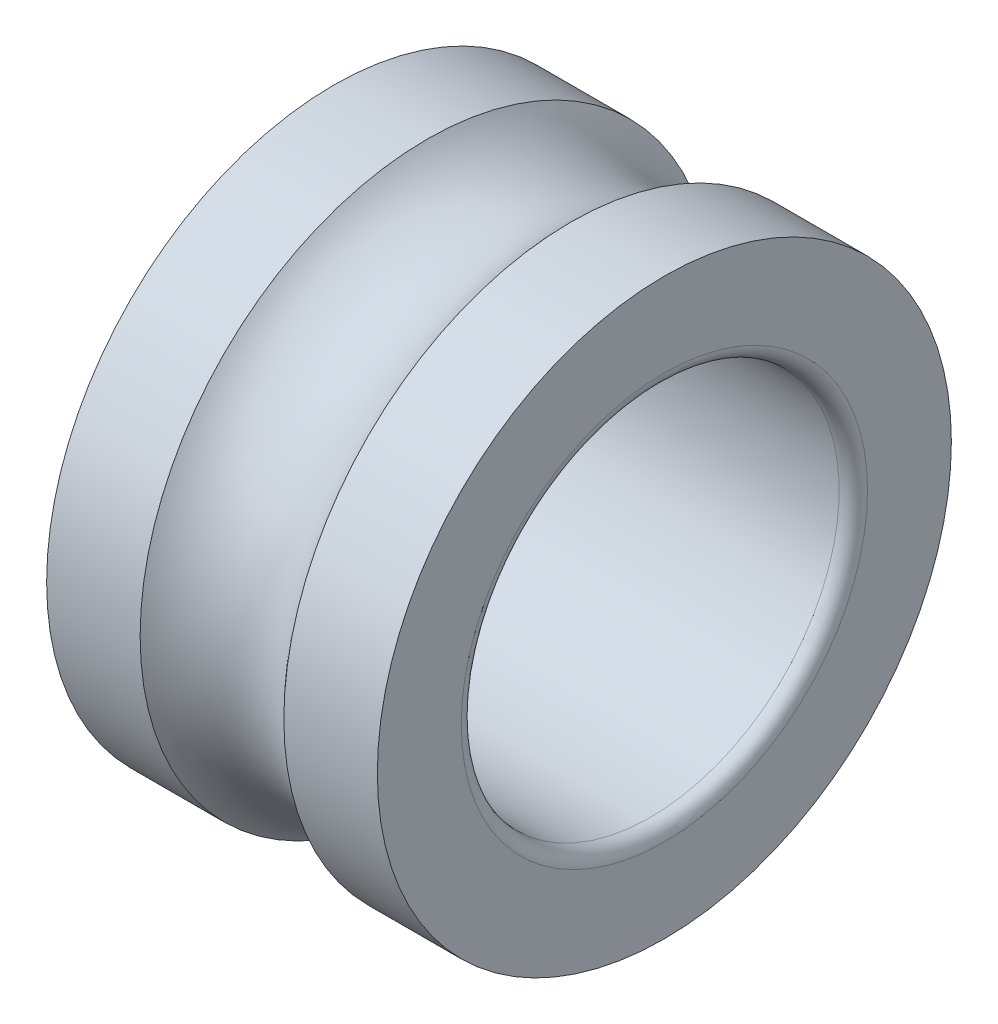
ISO-10303-21;
HEADER;
FILE_DESCRIPTION(('STEP AP214'),'2;1');
FILE_NAME('part.step','',(''),(''),'','','');
FILE_SCHEMA(('AUTOMOTIVE_DESIGN { 1 0 10303 214 1 1 1 1 }'));
ENDSEC;
DATA;
#1=APPLICATION_CONTEXT('core data for automotive mechanical design processes');
#2=APPLICATION_PROTOCOL_DEFINITION('international standard','automotive_design',2000,#1);
#3=PRODUCT_CONTEXT('',#1,'mechanical');
#4=PRODUCT('Part','Part','',(#3));
#5=PRODUCT_RELATED_PRODUCT_CATEGORY('part','',(#4));
#6=PRODUCT_DEFINITION_FORMATION('','',#4);
#7=PRODUCT_DEFINITION_CONTEXT('part definition',#1,'design');
#8=PRODUCT_DEFINITION('design','',#6,#7);
#9=PRODUCT_DEFINITION_SHAPE('','',#8);
#10=(LENGTH_UNIT() NAMED_UNIT(*) SI_UNIT(.MILLI.,.METRE.));
#11=(NAMED_UNIT(*) PLANE_ANGLE_UNIT() SI_UNIT($,.RADIAN.));
#12=(NAMED_UNIT(*) SI_UNIT($,.STERADIAN.) SOLID_ANGLE_UNIT());
#13=UNCERTAINTY_MEASURE_WITH_UNIT(LENGTH_MEASURE(1.E-05),#10,'distance_accuracy_value','');
#14=(GEOMETRIC_REPRESENTATION_CONTEXT(3) GLOBAL_UNCERTAINTY_ASSIGNED_CONTEXT((#13)) GLOBAL_UNIT_ASSIGNED_CONTEXT((#10,
#11,#12)) REPRESENTATION_CONTEXT('',''));
#15=CARTESIAN_POINT('',(0.,0.,0.));
#16=DIRECTION('',(0.,0.,1.));
#17=DIRECTION('',(1.,0.,0.));
#18=AXIS2_PLACEMENT_3D('',#15,#16,#17);
#19=CARTESIAN_POINT('',(0.,5.1875,0.));
#20=DIRECTION('',(-1.,0.,0.));
#21=DIRECTION('',(0.,0.,1.));
#22=AXIS2_PLACEMENT_3D('',#19,#20,#21);
#23=PLANE('',#22);
#24=CARTESIAN_POINT('',(0.,0.,0.));
#25=DIRECTION('',(1.,0.,0.));
#26=DIRECTION('',(0.,1.,0.));
#27=AXIS2_PLACEMENT_3D('',#24,#25,#26);
#28=CIRCLE('',#27,4.3);
#29=CARTESIAN_POINT('',(0.,0.,4.3));
#30=VERTEX_POINT('',#29);
#31=EDGE_CURVE('E69',#30,#30,#28,.T.);
#32=ORIENTED_EDGE('',*,*,#31,.T.);
#33=EDGE_LOOP('',(#32));
#34=FACE_BOUND('',#33,.T.);
#35=CARTESIAN_POINT('',(0.,0.,0.));
#36=DIRECTION('',(1.,0.,0.));
#37=DIRECTION('',(0.,1.,0.));
#38=AXIS2_PLACEMENT_3D('',#35,#36,#37);
#39=CIRCLE('',#38,6.075);
#40=CARTESIAN_POINT('',(0.,-6.075,0.));
#41=VERTEX_POINT('',#40);
#42=EDGE_CURVE('E61',#41,#41,#39,.T.);
#43=ORIENTED_EDGE('',*,*,#42,.F.);
#44=EDGE_LOOP('',(#43));
#45=FACE_BOUND('',#44,.T.);
#46=ADVANCED_FACE('F17',(#34,#45),#23,.T.);
#47=CARTESIAN_POINT('',(7.,5.1875,0.));
#48=DIRECTION('',(1.,0.,0.));
#49=DIRECTION('',(0.,1.,0.));
#50=AXIS2_PLACEMENT_3D('',#47,#48,#49);
#51=PLANE('',#50);
#52=CARTESIAN_POINT('',(7.,0.,0.));
#53=DIRECTION('',(1.,0.,0.));
#54=DIRECTION('',(0.,1.,0.));
#55=AXIS2_PLACEMENT_3D('',#52,#53,#54);
#56=CIRCLE('',#55,4.3);
#57=CARTESIAN_POINT('',(7.,0.,4.3));
#58=VERTEX_POINT('',#57);
#59=EDGE_CURVE('E11',#58,#58,#56,.T.);
#60=ORIENTED_EDGE('',*,*,#59,.F.);
#61=EDGE_LOOP('',(#60));
#62=FACE_BOUND('',#61,.T.);
#63=CARTESIAN_POINT('',(7.,0.,0.));
#64=DIRECTION('',(1.,0.,0.));
#65=DIRECTION('',(0.,1.,0.));
#66=AXIS2_PLACEMENT_3D('',#63,#64,#65);
#67=CIRCLE('',#66,6.075);
#68=CARTESIAN_POINT('',(7.,-6.075,0.));
#69=VERTEX_POINT('',#68);
#70=EDGE_CURVE('E57',#69,#69,#67,.T.);
#71=ORIENTED_EDGE('',*,*,#70,.T.);
#72=EDGE_LOOP('',(#71));
#73=FACE_BOUND('',#72,.T.);
#74=ADVANCED_FACE('F58',(#62,#73),#51,.T.);
#75=CARTESIAN_POINT('',(6.7,0.,0.));
#76=DIRECTION('',(1.,0.,0.));
#77=DIRECTION('',(0.,0.,-1.));
#78=AXIS2_PLACEMENT_3D('',#75,#76,#77);
#79=TOROIDAL_SURFACE('',#78,4.3,0.3);
#80=ORIENTED_EDGE('',*,*,#59,.T.);
#81=EDGE_LOOP('',(#80));
#82=FACE_BOUND('',#81,.T.);
#83=CARTESIAN_POINT('',(6.7,0.,0.));
#84=DIRECTION('',(1.,0.,0.));
#85=DIRECTION('',(0.,1.,0.));
#86=AXIS2_PLACEMENT_3D('',#83,#84,#85);
#87=CIRCLE('',#86,4.);
#88=CARTESIAN_POINT('',(6.7,0.,4.));
#89=VERTEX_POINT('',#88);
#90=EDGE_CURVE('E27',#89,#89,#87,.T.);
#91=ORIENTED_EDGE('',*,*,#90,.F.);
#92=EDGE_LOOP('',(#91));
#93=FACE_BOUND('',#92,.T.);
#94=ADVANCED_FACE('F97',(#82,#93),#79,.T.);
#95=CARTESIAN_POINT('',(3.5,0.,0.));
#96=DIRECTION('',(1.,0.,0.));
#97=DIRECTION('',(0.,1.,0.));
#98=AXIS2_PLACEMENT_3D('',#95,#96,#97);
#99=CYLINDRICAL_SURFACE('',#98,4.);
#100=CARTESIAN_POINT('',(0.3,0.,0.));
#101=DIRECTION('',(1.,0.,0.));
#102=DIRECTION('',(0.,1.,0.));
#103=AXIS2_PLACEMENT_3D('',#100,#101,#102);
#104=CIRCLE('',#103,4.);
#105=CARTESIAN_POINT('',(0.3,-4.,0.));
#106=VERTEX_POINT('',#105);
#107=EDGE_CURVE('E75',#106,#106,#104,.T.);
#108=ORIENTED_EDGE('',*,*,#107,.F.);
#109=EDGE_LOOP('',(#108));
#110=FACE_BOUND('',#109,.T.);
#111=ORIENTED_EDGE('',*,*,#90,.T.);
#112=EDGE_LOOP('',(#111));
#113=FACE_BOUND('',#112,.T.);
#114=ADVANCED_FACE('F89',(#110,#113),#99,.F.);
#115=CARTESIAN_POINT('',(0.3,0.,0.));
#116=DIRECTION('',(1.,0.,0.));
#117=DIRECTION('',(0.,0.,-1.));
#118=AXIS2_PLACEMENT_3D('',#115,#116,#117);
#119=TOROIDAL_SURFACE('',#118,4.3,0.3);
#120=ORIENTED_EDGE('',*,*,#107,.T.);
#121=EDGE_LOOP('',(#120));
#122=FACE_BOUND('',#121,.T.);
#123=ORIENTED_EDGE('',*,*,#31,.F.);
#124=EDGE_LOOP('',(#123));
#125=FACE_BOUND('',#124,.T.);
#126=ADVANCED_FACE('F87',(#122,#125),#119,.T.);
#127=CARTESIAN_POINT('',(0.989635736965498,0.,0.));
#128=DIRECTION('',(1.,0.,0.));
#129=DIRECTION('',(0.,1.,0.));
#130=AXIS2_PLACEMENT_3D('',#127,#128,#129);
#131=CYLINDRICAL_SURFACE('',#130,6.075);
#132=ORIENTED_EDGE('',*,*,#42,.T.);
#133=EDGE_LOOP('',(#132));
#134=FACE_BOUND('',#133,.T.);
#135=CARTESIAN_POINT('',(1.979271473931,0.,0.));
#136=DIRECTION('',(1.,0.,0.));
#137=DIRECTION('',(0.,1.,0.));
#138=AXIS2_PLACEMENT_3D('',#135,#136,#137);
#139=CIRCLE('',#138,6.075);
#140=CARTESIAN_POINT('',(1.979271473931,6.075,0.));
#141=VERTEX_POINT('',#140);
#142=EDGE_CURVE('E71',#141,#141,#139,.T.);
#143=ORIENTED_EDGE('',*,*,#142,.F.);
#144=EDGE_LOOP('',(#143));
#145=FACE_BOUND('',#144,.T.);
#146=ADVANCED_FACE('F19',(#134,#145),#131,.T.);
#147=CARTESIAN_POINT('',(6.0103642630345,0.,0.));
#148=DIRECTION('',(1.,0.,0.));
#149=DIRECTION('',(0.,1.,0.));
#150=AXIS2_PLACEMENT_3D('',#147,#148,#149);
#151=CYLINDRICAL_SURFACE('',#150,6.075);
#152=CARTESIAN_POINT('',(5.020728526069,0.,0.));
#153=DIRECTION('',(1.,0.,0.));
#154=DIRECTION('',(0.,1.,0.));
#155=AXIS2_PLACEMENT_3D('',#152,#153,#154);
#156=CIRCLE('',#155,6.075);
#157=CARTESIAN_POINT('',(5.020728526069,-6.075,0.));
#158=VERTEX_POINT('',#157);
#159=EDGE_CURVE('E62',#158,#158,#156,.T.);
#160=ORIENTED_EDGE('',*,*,#159,.T.);
#161=EDGE_LOOP('',(#160));
#162=FACE_BOUND('',#161,.T.);
#163=ORIENTED_EDGE('',*,*,#70,.F.);
#164=EDGE_LOOP('',(#163));
#165=FACE_BOUND('',#164,.T.);
#166=ADVANCED_FACE('F95',(#162,#165),#151,.T.);
#167=CARTESIAN_POINT('',(3.5,0.,0.));
#168=DIRECTION('',(1.,0.,0.));
#169=DIRECTION('',(0.,0.,-1.));
#170=AXIS2_PLACEMENT_3D('',#167,#168,#169);
#171=TOROIDAL_SURFACE('',#170,7.35,1.9845);
#172=ORIENTED_EDGE('',*,*,#159,.F.);
#173=EDGE_LOOP('',(#172));
#174=FACE_BOUND('',#173,.T.);
#175=ORIENTED_EDGE('',*,*,#142,.T.);
#176=EDGE_LOOP('',(#175));
#177=FACE_BOUND('',#176,.T.);
#178=ADVANCED_FACE('F108',(#174,#177),#171,.F.);
#179=CLOSED_SHELL('',(#46,#74,#94,#114,#126,#146,#166,#178));
#180=MANIFOLD_SOLID_BREP('B1',#179);
#181=ADVANCED_BREP_SHAPE_REPRESENTATION('',(#18,#180),#14);
#182=SHAPE_DEFINITION_REPRESENTATION(#9,#181);
ENDSEC;
END-ISO-10303-21;
